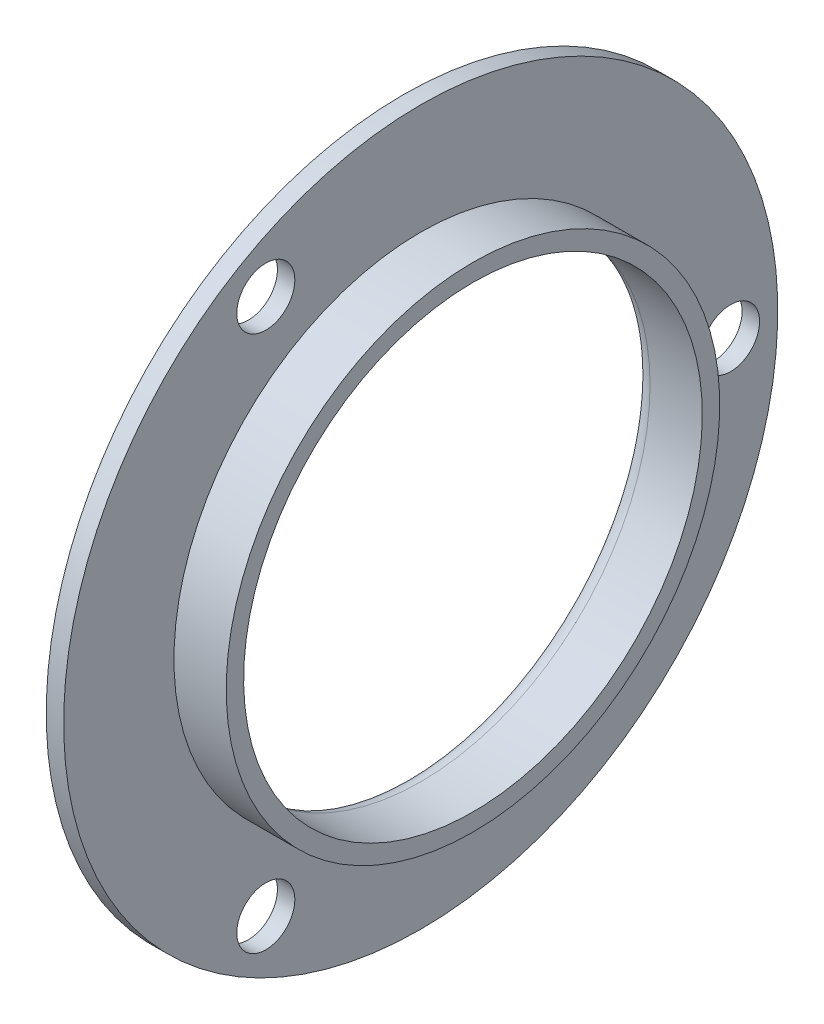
ISO-10303-21;
HEADER;
FILE_DESCRIPTION(('STEP AP214'),'2;1');
FILE_NAME('part.step','',(''),(''),'','','');
FILE_SCHEMA(('AUTOMOTIVE_DESIGN { 1 0 10303 214 1 1 1 1 }'));
ENDSEC;
DATA;
#1=APPLICATION_CONTEXT('core data for automotive mechanical design processes');
#2=APPLICATION_PROTOCOL_DEFINITION('international standard','automotive_design',2000,#1);
#3=PRODUCT_CONTEXT('',#1,'mechanical');
#4=PRODUCT('Part','Part','',(#3));
#5=PRODUCT_RELATED_PRODUCT_CATEGORY('part','',(#4));
#6=PRODUCT_DEFINITION_FORMATION('','',#4);
#7=PRODUCT_DEFINITION_CONTEXT('part definition',#1,'design');
#8=PRODUCT_DEFINITION('design','',#6,#7);
#9=PRODUCT_DEFINITION_SHAPE('','',#8);
#10=(LENGTH_UNIT() NAMED_UNIT(*) SI_UNIT(.MILLI.,.METRE.));
#11=(NAMED_UNIT(*) PLANE_ANGLE_UNIT() SI_UNIT($,.RADIAN.));
#12=(NAMED_UNIT(*) SI_UNIT($,.STERADIAN.) SOLID_ANGLE_UNIT());
#13=UNCERTAINTY_MEASURE_WITH_UNIT(LENGTH_MEASURE(1.E-05),#10,'distance_accuracy_value','');
#14=(GEOMETRIC_REPRESENTATION_CONTEXT(3) GLOBAL_UNCERTAINTY_ASSIGNED_CONTEXT((#13)) GLOBAL_UNIT_ASSIGNED_CONTEXT((#10,
#11,#12)) REPRESENTATION_CONTEXT('',''));
#15=CARTESIAN_POINT('',(0.,0.,0.));
#16=DIRECTION('',(0.,0.,1.));
#17=DIRECTION('',(1.,0.,0.));
#18=AXIS2_PLACEMENT_3D('',#15,#16,#17);
#19=CARTESIAN_POINT('',(-2.25,-19.75,0.));
#20=DIRECTION('',(1.,0.,0.));
#21=DIRECTION('',(0.,1.,0.));
#22=AXIS2_PLACEMENT_3D('',#19,#20,#21);
#23=CYLINDRICAL_SURFACE('',#22,21.25);
#24=CARTESIAN_POINT('',(0.,-19.75,0.));
#25=DIRECTION('',(1.,0.,0.));
#26=DIRECTION('',(0.,1.,0.));
#27=AXIS2_PLACEMENT_3D('',#24,#25,#26);
#28=CIRCLE('',#27,21.25);
#29=CARTESIAN_POINT('',(0.,1.5,0.));
#30=VERTEX_POINT('',#29);
#31=EDGE_CURVE('E20',#30,#30,#28,.T.);
#32=ORIENTED_EDGE('',*,*,#31,.F.);
#33=EDGE_LOOP('',(#32));
#34=FACE_BOUND('',#33,.T.);
#35=CARTESIAN_POINT('',(-4.5,-19.75,0.));
#36=DIRECTION('',(1.,0.,0.));
#37=DIRECTION('',(0.,1.,0.));
#38=AXIS2_PLACEMENT_3D('',#35,#36,#37);
#39=CIRCLE('',#38,21.25);
#40=CARTESIAN_POINT('',(-4.5,1.5,0.));
#41=VERTEX_POINT('',#40);
#42=EDGE_CURVE('E59',#41,#41,#39,.F.);
#43=ORIENTED_EDGE('',*,*,#42,.F.);
#44=EDGE_LOOP('',(#43));
#45=FACE_BOUND('',#44,.T.);
#46=ADVANCED_FACE('F15',(#34,#45),#23,.T.);
#47=CARTESIAN_POINT('',(0.,0.75,0.));
#48=DIRECTION('',(1.,0.,0.));
#49=DIRECTION('',(0.,0.,-1.));
#50=AXIS2_PLACEMENT_3D('',#47,#48,#49);
#51=PLANE('',#50);
#52=ORIENTED_EDGE('',*,*,#31,.T.);
#53=EDGE_LOOP('',(#52));
#54=FACE_BOUND('',#53,.T.);
#55=CARTESIAN_POINT('',(0.,-19.75,0.));
#56=DIRECTION('',(1.,0.,0.));
#57=DIRECTION('',(0.,1.,0.));
#58=AXIS2_PLACEMENT_3D('',#55,#56,#57);
#59=CIRCLE('',#58,19.75);
#60=CARTESIAN_POINT('',(0.,0.,0.));
#61=VERTEX_POINT('',#60);
#62=EDGE_CURVE('E57',#61,#61,#59,.T.);
#63=ORIENTED_EDGE('',*,*,#62,.F.);
#64=EDGE_LOOP('',(#63));
#65=FACE_BOUND('',#64,.T.);
#66=ADVANCED_FACE('F66',(#54,#65),#51,.T.);
#67=CARTESIAN_POINT('',(-4.5,6.25,0.));
#68=DIRECTION('',(1.,0.,0.));
#69=DIRECTION('',(0.,0.,-1.));
#70=AXIS2_PLACEMENT_3D('',#67,#68,#69);
#71=PLANE('',#70);
#72=CARTESIAN_POINT('',(-4.5,-19.75,0.));
#73=DIRECTION('',(1.,0.,0.));
#74=DIRECTION('',(0.,1.,0.));
#75=AXIS2_PLACEMENT_3D('',#72,#73,#74);
#76=CIRCLE('',#75,30.75);
#77=CARTESIAN_POINT('',(-4.5,11.,0.));
#78=VERTEX_POINT('',#77);
#79=EDGE_CURVE('E45',#78,#78,#76,.F.);
#80=ORIENTED_EDGE('',*,*,#79,.F.);
#81=EDGE_LOOP('',(#80));
#82=FACE_BOUND('',#81,.T.);
#83=ORIENTED_EDGE('',*,*,#42,.T.);
#84=EDGE_LOOP('',(#83));
#85=FACE_BOUND('',#84,.T.);
#86=CARTESIAN_POINT('',(-4.5,-19.75,-26.6805555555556));
#87=DIRECTION('',(1.,0.,0.));
#88=DIRECTION('',(0.,1.,0.));
#89=AXIS2_PLACEMENT_3D('',#86,#87,#88);
#90=CIRCLE('',#89,2.5);
#91=CARTESIAN_POINT('',(-4.5,-17.25,-26.6805555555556));
#92=VERTEX_POINT('',#91);
#93=EDGE_CURVE('E48',#92,#92,#90,.F.);
#94=ORIENTED_EDGE('',*,*,#93,.T.);
#95=EDGE_LOOP('',(#94));
#96=FACE_BOUND('',#95,.T.);
#97=CARTESIAN_POINT('',(-4.5,3.35603889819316,13.3402777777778));
#98=DIRECTION('',(1.,0.,0.));
#99=DIRECTION('',(0.,1.,0.));
#100=AXIS2_PLACEMENT_3D('',#97,#98,#99);
#101=CIRCLE('',#100,2.5);
#102=CARTESIAN_POINT('',(-4.5,5.85603889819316,13.3402777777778));
#103=VERTEX_POINT('',#102);
#104=EDGE_CURVE('E51',#103,#103,#101,.F.);
#105=ORIENTED_EDGE('',*,*,#104,.T.);
#106=EDGE_LOOP('',(#105));
#107=FACE_BOUND('',#106,.T.);
#108=CARTESIAN_POINT('',(-4.49999999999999,-42.8560388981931,13.3402777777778));
#109=DIRECTION('',(1.,0.,0.));
#110=DIRECTION('',(0.,1.,0.));
#111=AXIS2_PLACEMENT_3D('',#108,#109,#110);
#112=CIRCLE('',#111,2.5);
#113=CARTESIAN_POINT('',(-4.49999999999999,-40.3560388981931,13.3402777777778));
#114=VERTEX_POINT('',#113);
#115=EDGE_CURVE('E54',#114,#114,#112,.F.);
#116=ORIENTED_EDGE('',*,*,#115,.T.);
#117=EDGE_LOOP('',(#116));
#118=FACE_BOUND('',#117,.T.);
#119=ADVANCED_FACE('F76',(#82,#85,#96,#107,#118),#71,.T.);
#120=CARTESIAN_POINT('',(-4.5,-19.75,0.));
#121=DIRECTION('',(1.,0.,0.));
#122=DIRECTION('',(0.,1.,0.));
#123=AXIS2_PLACEMENT_3D('',#120,#121,#122);
#124=CYLINDRICAL_SURFACE('',#123,19.75);
#125=CARTESIAN_POINT('',(-4.5,-19.75,0.));
#126=DIRECTION('',(1.,0.,0.));
#127=DIRECTION('',(0.,0.,-1.));
#128=AXIS2_PLACEMENT_3D('',#125,#126,#127);
#129=CIRCLE('',#128,19.75);
#130=CARTESIAN_POINT('',(-4.5,-19.75,-19.75));
#131=VERTEX_POINT('',#130);
#132=EDGE_CURVE('E37',#131,#131,#129,.T.);
#133=ORIENTED_EDGE('',*,*,#132,.F.);
#134=EDGE_LOOP('',(#133));
#135=FACE_BOUND('',#134,.T.);
#136=ORIENTED_EDGE('',*,*,#62,.T.);
#137=EDGE_LOOP('',(#136));
#138=FACE_BOUND('',#137,.T.);
#139=ADVANCED_FACE('F95',(#135,#138),#124,.F.);
#140=CARTESIAN_POINT('',(-8.49999999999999,-42.8560388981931,13.3402777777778));
#141=DIRECTION('',(1.,0.,0.));
#142=DIRECTION('',(0.,1.,0.));
#143=AXIS2_PLACEMENT_3D('',#140,#141,#142);
#144=CYLINDRICAL_SURFACE('',#143,2.5);
#145=ORIENTED_EDGE('',*,*,#115,.F.);
#146=EDGE_LOOP('',(#145));
#147=FACE_BOUND('',#146,.T.);
#148=CARTESIAN_POINT('',(-5.99999999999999,-42.8560388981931,13.3402777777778));
#149=DIRECTION('',(1.,0.,0.));
#150=DIRECTION('',(0.,1.,0.));
#151=AXIS2_PLACEMENT_3D('',#148,#149,#150);
#152=CIRCLE('',#151,2.5);
#153=CARTESIAN_POINT('',(-5.99999999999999,-40.3560388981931,13.3402777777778));
#154=VERTEX_POINT('',#153);
#155=EDGE_CURVE('E42',#154,#154,#152,.T.);
#156=ORIENTED_EDGE('',*,*,#155,.F.);
#157=EDGE_LOOP('',(#156));
#158=FACE_BOUND('',#157,.T.);
#159=ADVANCED_FACE('F92',(#147,#158),#144,.F.);
#160=CARTESIAN_POINT('',(-8.5,3.35603889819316,13.3402777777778));
#161=DIRECTION('',(1.,0.,0.));
#162=DIRECTION('',(0.,1.,0.));
#163=AXIS2_PLACEMENT_3D('',#160,#161,#162);
#164=CYLINDRICAL_SURFACE('',#163,2.5);
#165=ORIENTED_EDGE('',*,*,#104,.F.);
#166=EDGE_LOOP('',(#165));
#167=FACE_BOUND('',#166,.T.);
#168=CARTESIAN_POINT('',(-6.,3.35603889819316,13.3402777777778));
#169=DIRECTION('',(1.,0.,0.));
#170=DIRECTION('',(0.,1.,0.));
#171=AXIS2_PLACEMENT_3D('',#168,#169,#170);
#172=CIRCLE('',#171,2.5);
#173=CARTESIAN_POINT('',(-6.,5.85603889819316,13.3402777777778));
#174=VERTEX_POINT('',#173);
#175=EDGE_CURVE('E34',#174,#174,#172,.T.);
#176=ORIENTED_EDGE('',*,*,#175,.F.);
#177=EDGE_LOOP('',(#176));
#178=FACE_BOUND('',#177,.T.);
#179=ADVANCED_FACE('F94',(#167,#178),#164,.F.);
#180=CARTESIAN_POINT('',(-8.5,-19.75,-26.6805555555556));
#181=DIRECTION('',(1.,0.,0.));
#182=DIRECTION('',(0.,1.,0.));
#183=AXIS2_PLACEMENT_3D('',#180,#181,#182);
#184=CYLINDRICAL_SURFACE('',#183,2.5);
#185=ORIENTED_EDGE('',*,*,#93,.F.);
#186=EDGE_LOOP('',(#185));
#187=FACE_BOUND('',#186,.T.);
#188=CARTESIAN_POINT('',(-6.,-19.75,-26.6805555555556));
#189=DIRECTION('',(1.,0.,0.));
#190=DIRECTION('',(0.,1.,0.));
#191=AXIS2_PLACEMENT_3D('',#188,#189,#190);
#192=CIRCLE('',#191,2.5);
#193=CARTESIAN_POINT('',(-6.,-17.25,-26.6805555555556));
#194=VERTEX_POINT('',#193);
#195=EDGE_CURVE('E29',#194,#194,#192,.T.);
#196=ORIENTED_EDGE('',*,*,#195,.F.);
#197=EDGE_LOOP('',(#196));
#198=FACE_BOUND('',#197,.T.);
#199=ADVANCED_FACE('F102',(#187,#198),#184,.F.);
#200=CARTESIAN_POINT('',(-5.25,-19.75,0.));
#201=DIRECTION('',(1.,0.,0.));
#202=DIRECTION('',(0.,1.,0.));
#203=AXIS2_PLACEMENT_3D('',#200,#201,#202);
#204=CYLINDRICAL_SURFACE('',#203,30.75);
#205=ORIENTED_EDGE('',*,*,#79,.T.);
#206=EDGE_LOOP('',(#205));
#207=FACE_BOUND('',#206,.T.);
#208=CARTESIAN_POINT('',(-6.,-19.75,0.));
#209=DIRECTION('',(1.,0.,0.));
#210=DIRECTION('',(0.,1.,0.));
#211=AXIS2_PLACEMENT_3D('',#208,#209,#210);
#212=CIRCLE('',#211,30.75);
#213=CARTESIAN_POINT('',(-6.,11.,0.));
#214=VERTEX_POINT('',#213);
#215=EDGE_CURVE('E24',#214,#214,#212,.F.);
#216=ORIENTED_EDGE('',*,*,#215,.F.);
#217=EDGE_LOOP('',(#216));
#218=FACE_BOUND('',#217,.T.);
#219=ADVANCED_FACE('F83',(#207,#218),#204,.T.);
#220=CARTESIAN_POINT('',(-4.5,-19.75,0.));
#221=DIRECTION('',(1.,0.,0.));
#222=DIRECTION('',(0.,0.,-1.));
#223=AXIS2_PLACEMENT_3D('',#220,#221,#222);
#224=TOROIDAL_SURFACE('',#223,21.25,1.5);
#225=CARTESIAN_POINT('',(-6.,-19.75,0.));
#226=DIRECTION('',(-1.,0.,0.));
#227=DIRECTION('',(0.,1.,0.));
#228=AXIS2_PLACEMENT_3D('',#225,#226,#227);
#229=CIRCLE('',#228,21.25);
#230=CARTESIAN_POINT('',(-6.,1.5,0.));
#231=VERTEX_POINT('',#230);
#232=EDGE_CURVE('E10',#231,#231,#229,.F.);
#233=ORIENTED_EDGE('',*,*,#232,.F.);
#234=EDGE_LOOP('',(#233));
#235=FACE_BOUND('',#234,.T.);
#236=ORIENTED_EDGE('',*,*,#132,.T.);
#237=EDGE_LOOP('',(#236));
#238=FACE_BOUND('',#237,.T.);
#239=ADVANCED_FACE('F79',(#235,#238),#224,.T.);
#240=CARTESIAN_POINT('',(-6.,5.5,0.));
#241=DIRECTION('',(-1.,0.,0.));
#242=DIRECTION('',(0.,-1.,0.));
#243=AXIS2_PLACEMENT_3D('',#240,#241,#242);
#244=PLANE('',#243);
#245=ORIENTED_EDGE('',*,*,#232,.T.);
#246=EDGE_LOOP('',(#245));
#247=FACE_BOUND('',#246,.T.);
#248=ORIENTED_EDGE('',*,*,#215,.T.);
#249=EDGE_LOOP('',(#248));
#250=FACE_BOUND('',#249,.T.);
#251=ORIENTED_EDGE('',*,*,#195,.T.);
#252=EDGE_LOOP('',(#251));
#253=FACE_BOUND('',#252,.T.);
#254=ORIENTED_EDGE('',*,*,#175,.T.);
#255=EDGE_LOOP('',(#254));
#256=FACE_BOUND('',#255,.T.);
#257=ORIENTED_EDGE('',*,*,#155,.T.);
#258=EDGE_LOOP('',(#257));
#259=FACE_BOUND('',#258,.T.);
#260=ADVANCED_FACE('F17',(#247,#250,#253,#256,#259),#244,.T.);
#261=CLOSED_SHELL('',(#46,#66,#119,#139,#159,#179,#199,#219,#239,#260));
#262=MANIFOLD_SOLID_BREP('B1',#261);
#263=ADVANCED_BREP_SHAPE_REPRESENTATION('',(#18,#262),#14);
#264=SHAPE_DEFINITION_REPRESENTATION(#9,#263);
ENDSEC;
END-ISO-10303-21;
